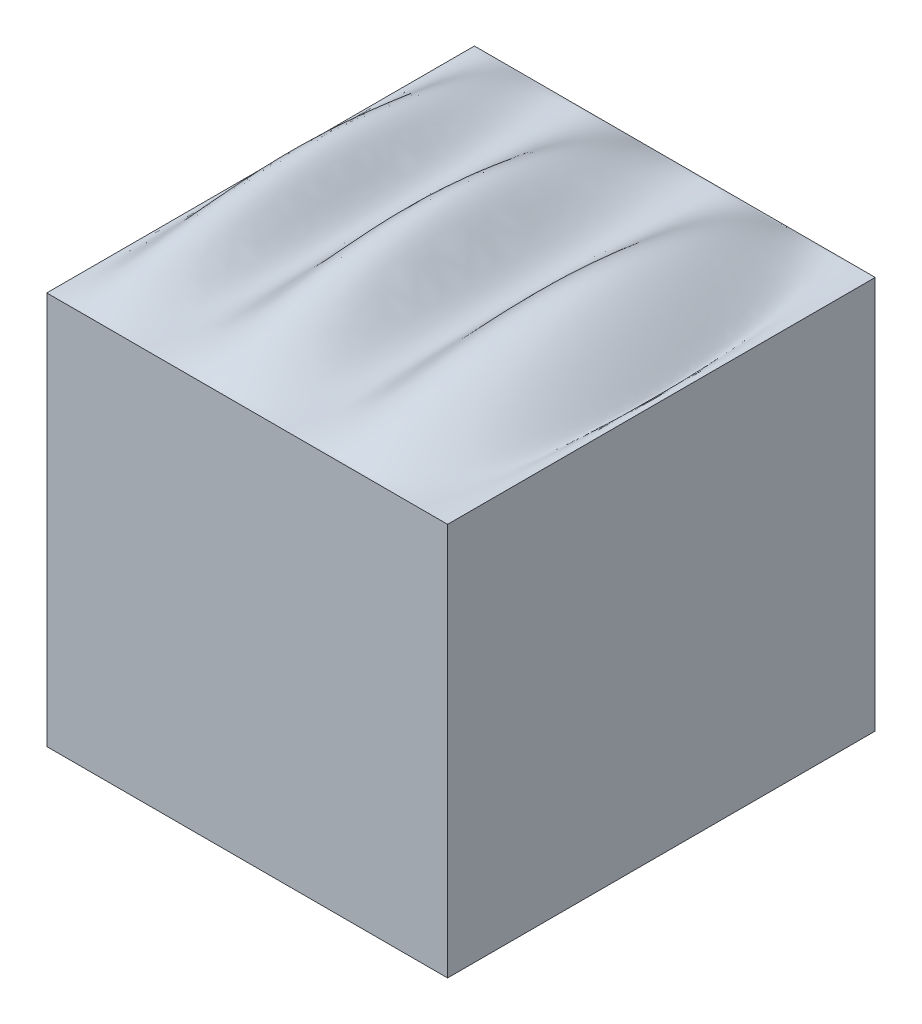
ISO-10303-21;
HEADER;
FILE_DESCRIPTION(('STEP AP214'),'2;1');
FILE_NAME('part.step','',(''),(''),'','','');
FILE_SCHEMA(('AUTOMOTIVE_DESIGN { 1 0 10303 214 1 1 1 1 }'));
ENDSEC;
DATA;
#1=APPLICATION_CONTEXT('core data for automotive mechanical design processes');
#2=APPLICATION_PROTOCOL_DEFINITION('international standard','automotive_design',2000,#1);
#3=PRODUCT_CONTEXT('',#1,'mechanical');
#4=PRODUCT('Part','Part','',(#3));
#5=PRODUCT_RELATED_PRODUCT_CATEGORY('part','',(#4));
#6=PRODUCT_DEFINITION_FORMATION('','',#4);
#7=PRODUCT_DEFINITION_CONTEXT('part definition',#1,'design');
#8=PRODUCT_DEFINITION('design','',#6,#7);
#9=PRODUCT_DEFINITION_SHAPE('','',#8);
#10=(LENGTH_UNIT() NAMED_UNIT(*) SI_UNIT(.MILLI.,.METRE.));
#11=(NAMED_UNIT(*) PLANE_ANGLE_UNIT() SI_UNIT($,.RADIAN.));
#12=(NAMED_UNIT(*) SI_UNIT($,.STERADIAN.) SOLID_ANGLE_UNIT());
#13=UNCERTAINTY_MEASURE_WITH_UNIT(LENGTH_MEASURE(1.E-05),#10,'distance_accuracy_value','');
#14=(GEOMETRIC_REPRESENTATION_CONTEXT(3) GLOBAL_UNCERTAINTY_ASSIGNED_CONTEXT((#13)) GLOBAL_UNIT_ASSIGNED_CONTEXT((#10,
#11,#12)) REPRESENTATION_CONTEXT('',''));
#15=CARTESIAN_POINT('',(0.,0.,0.));
#16=DIRECTION('',(0.,0.,1.));
#17=DIRECTION('',(1.,0.,0.));
#18=AXIS2_PLACEMENT_3D('',#15,#16,#17);
#19=CARTESIAN_POINT('',(27.377011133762,-26.8357142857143,29.21));
#20=DIRECTION('',(-1.,0.,0.));
#21=DIRECTION('',(0.,0.,1.));
#22=AXIS2_PLACEMENT_3D('',#19,#20,#21);
#23=PLANE('',#22);
#24=DIRECTION('',(0.,1.,0.));
#25=VECTOR('',#24,1.);
#26=CARTESIAN_POINT('',(27.377011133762,-26.8357142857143,-29.21));
#27=LINE('',#26,#25);
#28=CARTESIAN_POINT('',(27.377011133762,-26.8357142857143,-29.21));
#29=VERTEX_POINT('',#28);
#30=CARTESIAN_POINT('',(27.3770111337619,26.8357142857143,-29.21));
#31=VERTEX_POINT('',#30);
#32=EDGE_CURVE('E181',#29,#31,#27,.T.);
#33=ORIENTED_EDGE('',*,*,#32,.T.);
#34=DIRECTION('',(0.,0.,-1.));
#35=VECTOR('',#34,1.);
#36=CARTESIAN_POINT('',(27.377011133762,26.8357142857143,29.21));
#37=LINE('',#36,#35);
#38=CARTESIAN_POINT('',(27.3770111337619,26.8357142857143,29.21));
#39=VERTEX_POINT('',#38);
#40=EDGE_CURVE('E13',#39,#31,#37,.T.);
#41=ORIENTED_EDGE('',*,*,#40,.F.);
#42=DIRECTION('',(0.,1.,0.));
#43=VECTOR('',#42,1.);
#44=CARTESIAN_POINT('',(27.377011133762,-26.8357142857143,29.21));
#45=LINE('',#44,#43);
#46=CARTESIAN_POINT('',(27.377011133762,-26.8357142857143,29.21));
#47=VERTEX_POINT('',#46);
#48=EDGE_CURVE('E119',#47,#39,#45,.T.);
#49=ORIENTED_EDGE('',*,*,#48,.F.);
#50=DIRECTION('',(0.,0.,-1.));
#51=VECTOR('',#50,1.);
#52=CARTESIAN_POINT('',(27.377011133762,-26.8357142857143,29.21));
#53=LINE('',#52,#51);
#54=EDGE_CURVE('E141',#47,#29,#53,.T.);
#55=ORIENTED_EDGE('',*,*,#54,.T.);
#56=EDGE_LOOP('',(#33,#41,#49,#55));
#57=FACE_BOUND('',#56,.T.);
#58=ADVANCED_FACE('F72',(#57),#23,.F.);
#59=CARTESIAN_POINT('',(-27.377011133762,26.8357142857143,29.21));
#60=CARTESIAN_POINT('',(-25.5230547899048,26.8357142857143,29.21));
#61=CARTESIAN_POINT('',(-21.3044024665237,26.8357142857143,29.21));
#62=CARTESIAN_POINT('',(-13.6973404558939,26.8357142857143,29.21));
#63=CARTESIAN_POINT('',(-4.45157152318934,26.8357142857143,29.21));
#64=CARTESIAN_POINT('',(5.38365625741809,26.8357142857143,29.21));
#65=CARTESIAN_POINT('',(13.9314026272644,26.8357142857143,29.21));
#66=CARTESIAN_POINT('',(21.083018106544,26.8357142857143,29.21));
#67=CARTESIAN_POINT('',(25.2804787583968,26.8357142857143,29.21));
#68=CARTESIAN_POINT('',(27.3770111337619,26.8357142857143,29.21));
#69=CARTESIAN_POINT('',(-27.377011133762,26.8357142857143,19.5823468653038));
#70=CARTESIAN_POINT('',(-25.5230547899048,26.8357142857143,19.5823468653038));
#71=CARTESIAN_POINT('',(-22.0797391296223,33.104574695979,19.2394741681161));
#72=CARTESIAN_POINT('',(-12.7713092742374,22.6978532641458,19.4218175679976));
#73=CARTESIAN_POINT('',(-5.57789974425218,36.0887105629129,19.3528816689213));
#74=CARTESIAN_POINT('',(5.6516839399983,22.1696748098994,19.3566209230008));
#75=CARTESIAN_POINT('',(12.7634570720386,34.5935520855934,19.4046294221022));
#76=CARTESIAN_POINT('',(25.5760384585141,24.9520727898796,19.2679612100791));
#77=CARTESIAN_POINT('',(25.2804787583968,26.8357142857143,19.5823468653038));
#78=CARTESIAN_POINT('',(27.3770111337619,26.8357142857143,19.5823468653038));
#79=CARTESIAN_POINT('',(-27.377011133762,26.8357142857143,0.109013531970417));
#80=CARTESIAN_POINT('',(-25.5230547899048,26.8357142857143,0.109013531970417));
#81=CARTESIAN_POINT('',(-22.8726340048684,39.5153992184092,-0.584496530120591));
#82=CARTESIAN_POINT('',(-11.824307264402,18.4662865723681,-0.215680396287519));
#83=CARTESIAN_POINT('',(-6.7297347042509,45.5512494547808,-0.355113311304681));
#84=CARTESIAN_POINT('',(5.92578135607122,17.3979685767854,-0.347550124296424));
#85=CARTESIAN_POINT('',(11.5690623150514,42.5270732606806,-0.250445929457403));
#86=CARTESIAN_POINT('',(30.1708073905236,23.0257744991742,-0.526877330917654));
#87=CARTESIAN_POINT('',(25.2804787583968,26.8357142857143,0.109013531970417));
#88=CARTESIAN_POINT('',(27.3770111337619,26.8357142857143,0.109013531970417));
#89=CARTESIAN_POINT('',(-27.377011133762,26.8357142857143,-19.3643198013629));
#90=CARTESIAN_POINT('',(-25.5230547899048,26.8357142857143,-19.3643198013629));
#91=CARTESIAN_POINT('',(-22.0972973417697,33.2465388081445,-19.7149571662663));
#92=CARTESIAN_POINT('',(-12.7503384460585,22.6041475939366,-19.5284844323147));
#93=CARTESIAN_POINT('',(-5.60340648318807,36.2982531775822,-19.5989814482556));
#94=CARTESIAN_POINT('',(5.65775367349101,22.0640080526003,-19.5951575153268));
#95=CARTESIAN_POINT('',(12.7370078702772,34.7692354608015,-19.5460618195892));
#96=CARTESIAN_POINT('',(25.6777870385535,24.9094159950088,-19.6858250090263));
#97=CARTESIAN_POINT('',(25.2804787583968,26.8357142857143,-19.3643198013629));
#98=CARTESIAN_POINT('',(27.3770111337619,26.8357142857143,-19.3643198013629));
#99=CARTESIAN_POINT('',(-27.377011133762,26.8357142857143,-29.21));
#100=CARTESIAN_POINT('',(-25.5230547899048,26.8357142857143,-29.21));
#101=CARTESIAN_POINT('',(-21.3044024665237,26.8357142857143,-29.21));
#102=CARTESIAN_POINT('',(-13.6973404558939,26.8357142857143,-29.21));
#103=CARTESIAN_POINT('',(-4.45157152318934,26.8357142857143,-29.21));
#104=CARTESIAN_POINT('',(5.38365625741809,26.8357142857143,-29.21));
#105=CARTESIAN_POINT('',(13.9314026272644,26.8357142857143,-29.21));
#106=CARTESIAN_POINT('',(21.083018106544,26.8357142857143,-29.21));
#107=CARTESIAN_POINT('',(25.2804787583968,26.8357142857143,-29.21));
#108=CARTESIAN_POINT('',(27.3770111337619,26.8357142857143,-29.21));
#109=B_SPLINE_SURFACE_WITH_KNOTS('',3,3,((#59,#60,#61,#62,#63,#64,#65,#66,#67,#68),(#69,#70,#71,
#72,#73,#74,#75,#76,#77,#78),(#79,#80,#81,#82,#83,#84,#85,#86,#87,#88),(#89,#90,#91,#92,#93,#94,
#95,#96,#97,#98),(#99,#100,#101,#102,#103,#104,#105,#106,#107,#108)),.UNSPECIFIED.,.F.,.F.,.F.,
(4,1,4),(4,1,1,1,1,1,1,4),(0.,0.494401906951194,1.),(0.,0.101579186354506,0.231142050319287,
0.416794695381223,0.608159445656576,0.770019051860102,0.885129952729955,1.),.UNSPECIFIED.);
#110=DIRECTION('',(-1.,0.,0.));
#111=VECTOR('',#110,1.);
#112=CARTESIAN_POINT('',(-27.377011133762,26.8357142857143,-29.21));
#113=LINE('',#112,#111);
#114=CARTESIAN_POINT('',(-27.377011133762,26.8357142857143,-29.21));
#115=VERTEX_POINT('',#114);
#116=EDGE_CURVE('E129',#31,#115,#113,.T.);
#117=DIRECTION('',(0.,0.,-1.));
#118=VECTOR('',#117,1.);
#119=CARTESIAN_POINT('',(-27.377011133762,26.8357142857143,29.21));
#120=LINE('',#119,#118);
#121=CARTESIAN_POINT('',(-27.377011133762,26.8357142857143,29.21));
#122=VERTEX_POINT('',#121);
#123=EDGE_CURVE('E85',#122,#115,#120,.T.);
#124=DIRECTION('',(-1.,0.,0.));
#125=VECTOR('',#124,1.);
#126=CARTESIAN_POINT('',(-27.377011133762,26.8357142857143,29.21));
#127=LINE('',#126,#125);
#128=EDGE_CURVE('E111',#39,#122,#127,.T.);
#129=ORIENTED_EDGE('',*,*,#116,.T.);
#130=ORIENTED_EDGE('',*,*,#123,.F.);
#131=ORIENTED_EDGE('',*,*,#128,.F.);
#132=ORIENTED_EDGE('',*,*,#40,.T.);
#133=EDGE_LOOP('',(#129,#130,#131,#132));
#134=FACE_BOUND('',#133,.T.);
#135=ADVANCED_FACE('F74',(#134),#109,.F.);
#136=CARTESIAN_POINT('',(-27.377011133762,-26.8357142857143,29.21));
#137=DIRECTION('',(1.,0.,0.));
#138=DIRECTION('',(0.,0.,-1.));
#139=AXIS2_PLACEMENT_3D('',#136,#137,#138);
#140=PLANE('',#139);
#141=DIRECTION('',(0.,-1.,0.));
#142=VECTOR('',#141,1.);
#143=CARTESIAN_POINT('',(-27.377011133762,-26.8357142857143,-29.21));
#144=LINE('',#143,#142);
#145=CARTESIAN_POINT('',(-27.377011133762,-26.8357142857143,-29.21));
#146=VERTEX_POINT('',#145);
#147=EDGE_CURVE('E188',#115,#146,#144,.T.);
#148=ORIENTED_EDGE('',*,*,#147,.T.);
#149=DIRECTION('',(0.,0.,-1.));
#150=VECTOR('',#149,1.);
#151=CARTESIAN_POINT('',(-27.377011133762,-26.8357142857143,29.21));
#152=LINE('',#151,#150);
#153=CARTESIAN_POINT('',(-27.377011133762,-26.8357142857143,29.21));
#154=VERTEX_POINT('',#153);
#155=EDGE_CURVE('E134',#154,#146,#152,.T.);
#156=ORIENTED_EDGE('',*,*,#155,.F.);
#157=DIRECTION('',(0.,-1.,0.));
#158=VECTOR('',#157,1.);
#159=CARTESIAN_POINT('',(-27.377011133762,-26.8357142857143,29.21));
#160=LINE('',#159,#158);
#161=EDGE_CURVE('E116',#122,#154,#160,.T.);
#162=ORIENTED_EDGE('',*,*,#161,.F.);
#163=ORIENTED_EDGE('',*,*,#123,.T.);
#164=EDGE_LOOP('',(#148,#156,#162,#163));
#165=FACE_BOUND('',#164,.T.);
#166=ADVANCED_FACE('F138',(#165),#140,.F.);
#167=CARTESIAN_POINT('',(-27.377011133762,-26.8357142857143,29.21));
#168=DIRECTION('',(0.,1.,0.));
#169=DIRECTION('',(0.,0.,1.));
#170=AXIS2_PLACEMENT_3D('',#167,#168,#169);
#171=PLANE('',#170);
#172=DIRECTION('',(1.,0.,0.));
#173=VECTOR('',#172,1.);
#174=CARTESIAN_POINT('',(-27.377011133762,-26.8357142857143,-29.21));
#175=LINE('',#174,#173);
#176=EDGE_CURVE('E178',#146,#29,#175,.T.);
#177=ORIENTED_EDGE('',*,*,#176,.T.);
#178=ORIENTED_EDGE('',*,*,#54,.F.);
#179=DIRECTION('',(1.,0.,0.));
#180=VECTOR('',#179,1.);
#181=CARTESIAN_POINT('',(-27.377011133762,-26.8357142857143,29.21));
#182=LINE('',#181,#180);
#183=EDGE_CURVE('E94',#154,#47,#182,.T.);
#184=ORIENTED_EDGE('',*,*,#183,.F.);
#185=ORIENTED_EDGE('',*,*,#155,.T.);
#186=EDGE_LOOP('',(#177,#178,#184,#185));
#187=FACE_BOUND('',#186,.T.);
#188=ADVANCED_FACE('F161',(#187),#171,.F.);
#189=CARTESIAN_POINT('',(0.,0.,29.21));
#190=DIRECTION('',(0.,0.,-1.));
#191=DIRECTION('',(-1.,0.,0.));
#192=AXIS2_PLACEMENT_3D('',#189,#190,#191);
#193=PLANE('',#192);
#194=ORIENTED_EDGE('',*,*,#48,.T.);
#195=ORIENTED_EDGE('',*,*,#128,.T.);
#196=ORIENTED_EDGE('',*,*,#161,.T.);
#197=ORIENTED_EDGE('',*,*,#183,.T.);
#198=EDGE_LOOP('',(#194,#195,#196,#197));
#199=FACE_BOUND('',#198,.T.);
#200=ADVANCED_FACE('F114',(#199),#193,.F.);
#201=CARTESIAN_POINT('',(0.,0.,-29.21));
#202=DIRECTION('',(0.,0.,-1.));
#203=DIRECTION('',(-1.,0.,0.));
#204=AXIS2_PLACEMENT_3D('',#201,#202,#203);
#205=PLANE('',#204);
#206=ORIENTED_EDGE('',*,*,#32,.F.);
#207=ORIENTED_EDGE('',*,*,#176,.F.);
#208=ORIENTED_EDGE('',*,*,#147,.F.);
#209=ORIENTED_EDGE('',*,*,#116,.F.);
#210=EDGE_LOOP('',(#206,#207,#208,#209));
#211=FACE_BOUND('',#210,.T.);
#212=ADVANCED_FACE('F195',(#211),#205,.T.);
#213=CLOSED_SHELL('',(#58,#135,#166,#188,#200,#212));
#214=MANIFOLD_SOLID_BREP('B2',#213);
#215=ADVANCED_BREP_SHAPE_REPRESENTATION('',(#18,#214),#14);
#216=SHAPE_DEFINITION_REPRESENTATION(#9,#215);
ENDSEC;
END-ISO-10303-21;
